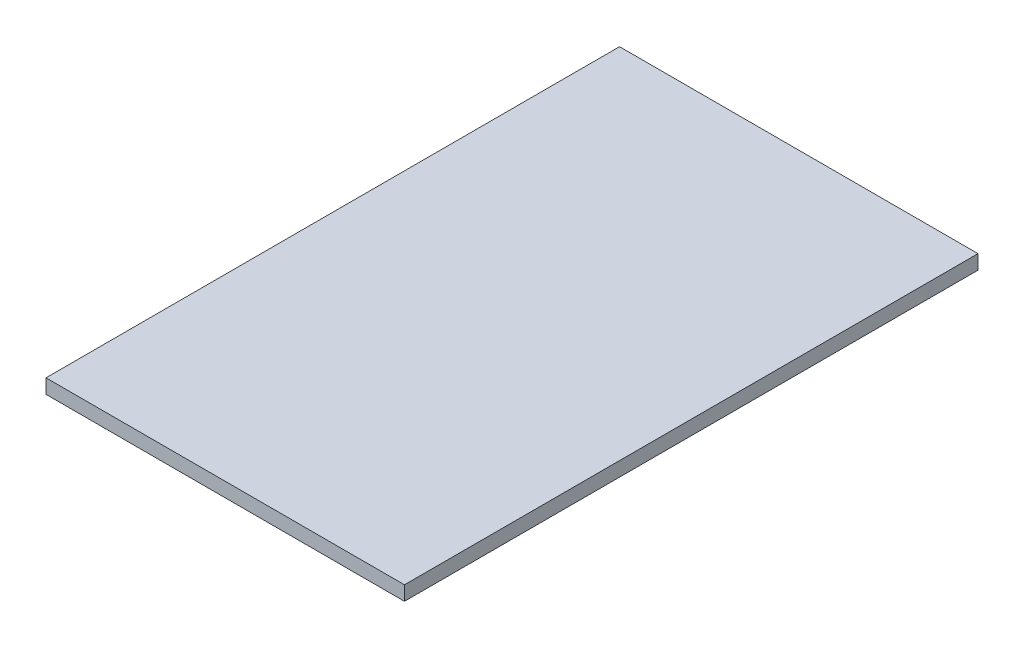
from build123d import *

# Parameters (mm, degrees)
SKETCH2_W           = 63.5
SKETCH2_H           = 101.6
BOSS_EXTRUDE1_DEPTH = 2.54


with BuildPart() as part:
    # Sketch2 → Boss-Extrude1 (new body)
    with BuildSketch(Plane(origin=(0, 0, 0), x_dir=(1, 0, 0), z_dir=(0, 1, 0))):
        with Locations((31.75, 50.8)):
            Rectangle(SKETCH2_W, SKETCH2_H)
    extrude(amount=BOSS_EXTRUDE1_DEPTH)


solid = part.part
